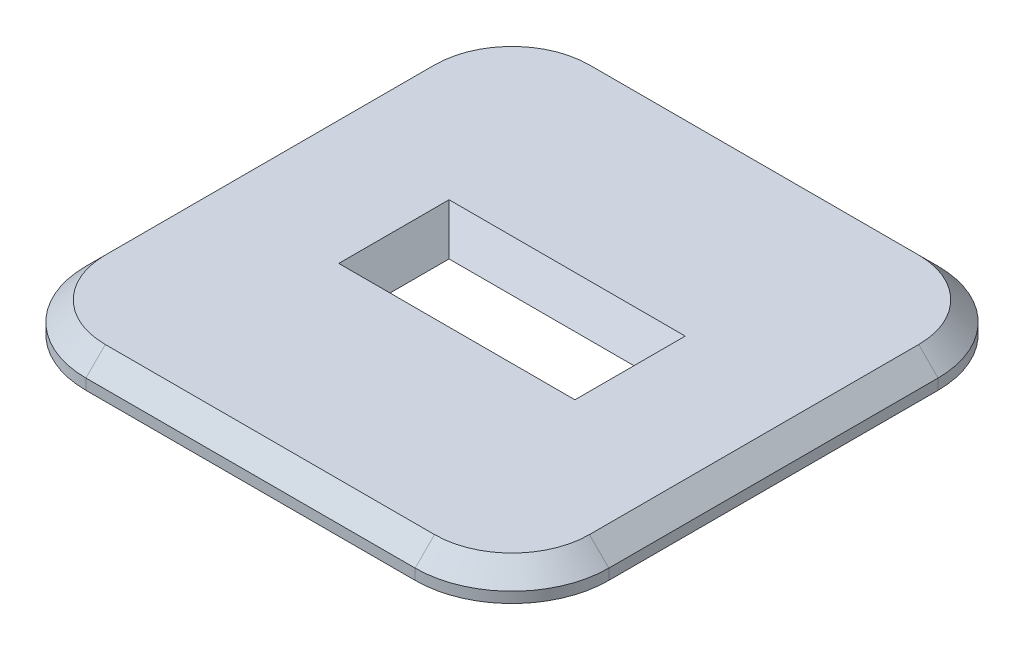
ISO-10303-21;
HEADER;
FILE_DESCRIPTION(('STEP AP214'),'2;1');
FILE_NAME('part.step','',(''),(''),'','','');
FILE_SCHEMA(('AUTOMOTIVE_DESIGN { 1 0 10303 214 1 1 1 1 }'));
ENDSEC;
DATA;
#1=APPLICATION_CONTEXT('core data for automotive mechanical design processes');
#2=APPLICATION_PROTOCOL_DEFINITION('international standard','automotive_design',2000,#1);
#3=PRODUCT_CONTEXT('',#1,'mechanical');
#4=PRODUCT('Part','Part','',(#3));
#5=PRODUCT_RELATED_PRODUCT_CATEGORY('part','',(#4));
#6=PRODUCT_DEFINITION_FORMATION('','',#4);
#7=PRODUCT_DEFINITION_CONTEXT('part definition',#1,'design');
#8=PRODUCT_DEFINITION('design','',#6,#7);
#9=PRODUCT_DEFINITION_SHAPE('','',#8);
#10=(LENGTH_UNIT() NAMED_UNIT(*) SI_UNIT(.MILLI.,.METRE.));
#11=(NAMED_UNIT(*) PLANE_ANGLE_UNIT() SI_UNIT($,.RADIAN.));
#12=(NAMED_UNIT(*) SI_UNIT($,.STERADIAN.) SOLID_ANGLE_UNIT());
#13=UNCERTAINTY_MEASURE_WITH_UNIT(LENGTH_MEASURE(1.E-05),#10,'distance_accuracy_value','');
#14=(GEOMETRIC_REPRESENTATION_CONTEXT(3) GLOBAL_UNCERTAINTY_ASSIGNED_CONTEXT((#13)) GLOBAL_UNIT_ASSIGNED_CONTEXT((#10,
#11,#12)) REPRESENTATION_CONTEXT('',''));
#15=CARTESIAN_POINT('',(0.,0.,0.));
#16=DIRECTION('',(0.,0.,1.));
#17=DIRECTION('',(1.,0.,0.));
#18=AXIS2_PLACEMENT_3D('',#15,#16,#17);
#19=CARTESIAN_POINT('',(-2.7,0.31,-2.7));
#20=DIRECTION('',(1.,0.,0.));
#21=DIRECTION('',(0.,0.,-1.));
#22=AXIS2_PLACEMENT_3D('',#19,#20,#21);
#23=PLANE('',#22);
#24=DIRECTION('',(0.,-1.,0.));
#25=VECTOR('',#24,1.);
#26=CARTESIAN_POINT('',(-2.7,0.31,1.7));
#27=LINE('',#26,#25);
#28=CARTESIAN_POINT('',(-2.7,0.,1.7));
#29=VERTEX_POINT('',#28);
#30=CARTESIAN_POINT('',(-2.7,0.11,1.7));
#31=VERTEX_POINT('',#30);
#32=EDGE_CURVE('E195',#29,#31,#27,.F.);
#33=ORIENTED_EDGE('',*,*,#32,.T.);
#34=DIRECTION('',(0.,0.,-1.));
#35=VECTOR('',#34,1.);
#36=CARTESIAN_POINT('',(-2.7,0.11,-2.7));
#37=LINE('',#36,#35);
#38=CARTESIAN_POINT('',(-2.7,0.11,-1.7));
#39=VERTEX_POINT('',#38);
#40=EDGE_CURVE('E247',#31,#39,#37,.T.);
#41=ORIENTED_EDGE('',*,*,#40,.T.);
#42=DIRECTION('',(0.,-1.,0.));
#43=VECTOR('',#42,1.);
#44=CARTESIAN_POINT('',(-2.7,0.31,-1.7));
#45=LINE('',#44,#43);
#46=CARTESIAN_POINT('',(-2.7,0.,-1.7));
#47=VERTEX_POINT('',#46);
#48=EDGE_CURVE('E198',#39,#47,#45,.T.);
#49=ORIENTED_EDGE('',*,*,#48,.T.);
#50=DIRECTION('',(0.,0.,1.));
#51=VECTOR('',#50,1.);
#52=CARTESIAN_POINT('',(-2.7,0.,-2.7));
#53=LINE('',#52,#51);
#54=EDGE_CURVE('E182',#47,#29,#53,.T.);
#55=ORIENTED_EDGE('',*,*,#54,.T.);
#56=EDGE_LOOP('',(#33,#41,#49,#55));
#57=FACE_BOUND('',#56,.T.);
#58=ADVANCED_FACE('F42',(#57),#23,.F.);
#59=CARTESIAN_POINT('',(2.7,0.31,2.7));
#60=DIRECTION('',(0.,0.,-1.));
#61=DIRECTION('',(-1.,0.,0.));
#62=AXIS2_PLACEMENT_3D('',#59,#60,#61);
#63=PLANE('',#62);
#64=DIRECTION('',(0.,-1.,0.));
#65=VECTOR('',#64,1.);
#66=CARTESIAN_POINT('',(1.7,0.31,2.7));
#67=LINE('',#66,#65);
#68=CARTESIAN_POINT('',(1.7,0.,2.7));
#69=VERTEX_POINT('',#68);
#70=CARTESIAN_POINT('',(1.7,0.11,2.7));
#71=VERTEX_POINT('',#70);
#72=EDGE_CURVE('E220',#69,#71,#67,.F.);
#73=ORIENTED_EDGE('',*,*,#72,.T.);
#74=DIRECTION('',(-1.,0.,0.));
#75=VECTOR('',#74,1.);
#76=CARTESIAN_POINT('',(2.7,0.11,2.7));
#77=LINE('',#76,#75);
#78=CARTESIAN_POINT('',(-1.7,0.11,2.7));
#79=VERTEX_POINT('',#78);
#80=EDGE_CURVE('E243',#71,#79,#77,.T.);
#81=ORIENTED_EDGE('',*,*,#80,.T.);
#82=DIRECTION('',(0.,-1.,0.));
#83=VECTOR('',#82,1.);
#84=CARTESIAN_POINT('',(-1.7,0.31,2.7));
#85=LINE('',#84,#83);
#86=CARTESIAN_POINT('',(-1.7,0.,2.7));
#87=VERTEX_POINT('',#86);
#88=EDGE_CURVE('E218',#79,#87,#85,.T.);
#89=ORIENTED_EDGE('',*,*,#88,.T.);
#90=DIRECTION('',(1.,0.,0.));
#91=VECTOR('',#90,1.);
#92=CARTESIAN_POINT('',(2.7,0.,2.7));
#93=LINE('',#92,#91);
#94=EDGE_CURVE('E185',#87,#69,#93,.T.);
#95=ORIENTED_EDGE('',*,*,#94,.T.);
#96=EDGE_LOOP('',(#73,#81,#89,#95));
#97=FACE_BOUND('',#96,.T.);
#98=ADVANCED_FACE('F298',(#97),#63,.F.);
#99=CARTESIAN_POINT('',(2.7,0.31,-2.7));
#100=DIRECTION('',(-1.,0.,0.));
#101=DIRECTION('',(0.,0.,1.));
#102=AXIS2_PLACEMENT_3D('',#99,#100,#101);
#103=PLANE('',#102);
#104=DIRECTION('',(0.,-1.,0.));
#105=VECTOR('',#104,1.);
#106=CARTESIAN_POINT('',(2.7,0.31,-1.7));
#107=LINE('',#106,#105);
#108=CARTESIAN_POINT('',(2.7,0.,-1.7));
#109=VERTEX_POINT('',#108);
#110=CARTESIAN_POINT('',(2.7,0.11,-1.7));
#111=VERTEX_POINT('',#110);
#112=EDGE_CURVE('E215',#109,#111,#107,.F.);
#113=ORIENTED_EDGE('',*,*,#112,.T.);
#114=DIRECTION('',(0.,0.,1.));
#115=VECTOR('',#114,1.);
#116=CARTESIAN_POINT('',(2.7,0.11,-2.7));
#117=LINE('',#116,#115);
#118=CARTESIAN_POINT('',(2.7,0.11,1.7));
#119=VERTEX_POINT('',#118);
#120=EDGE_CURVE('E255',#111,#119,#117,.T.);
#121=ORIENTED_EDGE('',*,*,#120,.T.);
#122=DIRECTION('',(0.,-1.,0.));
#123=VECTOR('',#122,1.);
#124=CARTESIAN_POINT('',(2.7,0.31,1.7));
#125=LINE('',#124,#123);
#126=CARTESIAN_POINT('',(2.7,0.,1.7));
#127=VERTEX_POINT('',#126);
#128=EDGE_CURVE('E213',#119,#127,#125,.T.);
#129=ORIENTED_EDGE('',*,*,#128,.T.);
#130=DIRECTION('',(0.,0.,-1.));
#131=VECTOR('',#130,1.);
#132=CARTESIAN_POINT('',(2.7,0.,-2.7));
#133=LINE('',#132,#131);
#134=EDGE_CURVE('E189',#127,#109,#133,.T.);
#135=ORIENTED_EDGE('',*,*,#134,.T.);
#136=EDGE_LOOP('',(#113,#121,#129,#135));
#137=FACE_BOUND('',#136,.T.);
#138=ADVANCED_FACE('F304',(#137),#103,.F.);
#139=CARTESIAN_POINT('',(2.7,0.31,-2.7));
#140=DIRECTION('',(0.,0.,1.));
#141=DIRECTION('',(1.,0.,0.));
#142=AXIS2_PLACEMENT_3D('',#139,#140,#141);
#143=PLANE('',#142);
#144=DIRECTION('',(0.,-1.,0.));
#145=VECTOR('',#144,1.);
#146=CARTESIAN_POINT('',(-1.7,0.31,-2.7));
#147=LINE('',#146,#145);
#148=CARTESIAN_POINT('',(-1.7,0.,-2.7));
#149=VERTEX_POINT('',#148);
#150=CARTESIAN_POINT('',(-1.7,0.11,-2.7));
#151=VERTEX_POINT('',#150);
#152=EDGE_CURVE('E210',#149,#151,#147,.F.);
#153=ORIENTED_EDGE('',*,*,#152,.T.);
#154=DIRECTION('',(1.,0.,0.));
#155=VECTOR('',#154,1.);
#156=CARTESIAN_POINT('',(2.7,0.11,-2.7));
#157=LINE('',#156,#155);
#158=CARTESIAN_POINT('',(1.7,0.11,-2.7));
#159=VERTEX_POINT('',#158);
#160=EDGE_CURVE('E251',#151,#159,#157,.T.);
#161=ORIENTED_EDGE('',*,*,#160,.T.);
#162=DIRECTION('',(0.,-1.,0.));
#163=VECTOR('',#162,1.);
#164=CARTESIAN_POINT('',(1.7,0.31,-2.7));
#165=LINE('',#164,#163);
#166=CARTESIAN_POINT('',(1.7,0.,-2.7));
#167=VERTEX_POINT('',#166);
#168=EDGE_CURVE('E208',#159,#167,#165,.T.);
#169=ORIENTED_EDGE('',*,*,#168,.T.);
#170=DIRECTION('',(-1.,0.,0.));
#171=VECTOR('',#170,1.);
#172=CARTESIAN_POINT('',(2.7,0.,-2.7));
#173=LINE('',#172,#171);
#174=EDGE_CURVE('E192',#167,#149,#173,.T.);
#175=ORIENTED_EDGE('',*,*,#174,.T.);
#176=EDGE_LOOP('',(#153,#161,#169,#175));
#177=FACE_BOUND('',#176,.T.);
#178=ADVANCED_FACE('F402',(#177),#143,.F.);
#179=CARTESIAN_POINT('',(0.,0.31,0.));
#180=DIRECTION('',(0.,-1.,0.));
#181=DIRECTION('',(0.,0.,-1.));
#182=AXIS2_PLACEMENT_3D('',#179,#180,#181);
#183=PLANE('',#182);
#184=DIRECTION('',(0.,0.,1.));
#185=VECTOR('',#184,1.);
#186=CARTESIAN_POINT('',(1.21949223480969,0.31,0.));
#187=LINE('',#186,#185);
#188=CARTESIAN_POINT('',(1.21949223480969,0.31,-0.569492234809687));
#189=VERTEX_POINT('',#188);
#190=CARTESIAN_POINT('',(1.21949223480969,0.31,0.569492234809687));
#191=VERTEX_POINT('',#190);
#192=EDGE_CURVE('E52',#189,#191,#187,.T.);
#193=ORIENTED_EDGE('',*,*,#192,.T.);
#194=DIRECTION('',(-1.,0.,0.));
#195=VECTOR('',#194,1.);
#196=CARTESIAN_POINT('',(0.,0.31,0.569492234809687));
#197=LINE('',#196,#195);
#198=CARTESIAN_POINT('',(-1.21949223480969,0.31,0.569492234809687));
#199=VERTEX_POINT('',#198);
#200=EDGE_CURVE('E11',#191,#199,#197,.T.);
#201=ORIENTED_EDGE('',*,*,#200,.T.);
#202=DIRECTION('',(0.,0.,-1.));
#203=VECTOR('',#202,1.);
#204=CARTESIAN_POINT('',(-1.21949223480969,0.31,0.));
#205=LINE('',#204,#203);
#206=CARTESIAN_POINT('',(-1.21949223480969,0.31,-0.569492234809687));
#207=VERTEX_POINT('',#206);
#208=EDGE_CURVE('E169',#199,#207,#205,.T.);
#209=ORIENTED_EDGE('',*,*,#208,.T.);
#210=DIRECTION('',(1.,0.,0.));
#211=VECTOR('',#210,1.);
#212=CARTESIAN_POINT('',(0.,0.31,-0.569492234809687));
#213=LINE('',#212,#211);
#214=EDGE_CURVE('E257',#207,#189,#213,.T.);
#215=ORIENTED_EDGE('',*,*,#214,.T.);
#216=EDGE_LOOP('',(#193,#201,#209,#215));
#217=FACE_BOUND('',#216,.T.);
#218=DIRECTION('',(1.,0.,0.));
#219=VECTOR('',#218,1.);
#220=CARTESIAN_POINT('',(0.,0.31,2.5));
#221=LINE('',#220,#219);
#222=CARTESIAN_POINT('',(-1.7,0.31,2.5));
#223=VERTEX_POINT('',#222);
#224=CARTESIAN_POINT('',(1.7,0.31,2.5));
#225=VERTEX_POINT('',#224);
#226=EDGE_CURVE('E235',#223,#225,#221,.T.);
#227=ORIENTED_EDGE('',*,*,#226,.T.);
#228=CARTESIAN_POINT('',(1.7,0.31,1.7));
#229=DIRECTION('',(0.,-1.,0.));
#230=DIRECTION('',(0.,0.,-1.));
#231=AXIS2_PLACEMENT_3D('',#228,#229,#230);
#232=CIRCLE('',#231,0.800000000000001);
#233=CARTESIAN_POINT('',(2.5,0.31,1.7));
#234=VERTEX_POINT('',#233);
#235=EDGE_CURVE('E237',#225,#234,#232,.F.);
#236=ORIENTED_EDGE('',*,*,#235,.T.);
#237=DIRECTION('',(0.,0.,-1.));
#238=VECTOR('',#237,1.);
#239=CARTESIAN_POINT('',(2.5,0.31,0.));
#240=LINE('',#239,#238);
#241=CARTESIAN_POINT('',(2.5,0.31,-1.7));
#242=VERTEX_POINT('',#241);
#243=EDGE_CURVE('E223',#234,#242,#240,.T.);
#244=ORIENTED_EDGE('',*,*,#243,.T.);
#245=CARTESIAN_POINT('',(1.7,0.31,-1.7));
#246=DIRECTION('',(0.,-1.,0.));
#247=DIRECTION('',(0.,0.,-1.));
#248=AXIS2_PLACEMENT_3D('',#245,#246,#247);
#249=CIRCLE('',#248,0.800000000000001);
#250=CARTESIAN_POINT('',(1.7,0.31,-2.5));
#251=VERTEX_POINT('',#250);
#252=EDGE_CURVE('E225',#242,#251,#249,.F.);
#253=ORIENTED_EDGE('',*,*,#252,.T.);
#254=DIRECTION('',(-1.,0.,0.));
#255=VECTOR('',#254,1.);
#256=CARTESIAN_POINT('',(0.,0.31,-2.5));
#257=LINE('',#256,#255);
#258=CARTESIAN_POINT('',(-1.7,0.31,-2.5));
#259=VERTEX_POINT('',#258);
#260=EDGE_CURVE('E227',#251,#259,#257,.T.);
#261=ORIENTED_EDGE('',*,*,#260,.T.);
#262=CARTESIAN_POINT('',(-1.7,0.31,-1.7));
#263=DIRECTION('',(0.,-1.,0.));
#264=DIRECTION('',(0.,0.,-1.));
#265=AXIS2_PLACEMENT_3D('',#262,#263,#264);
#266=CIRCLE('',#265,0.800000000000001);
#267=CARTESIAN_POINT('',(-2.5,0.31,-1.7));
#268=VERTEX_POINT('',#267);
#269=EDGE_CURVE('E229',#259,#268,#266,.F.);
#270=ORIENTED_EDGE('',*,*,#269,.T.);
#271=DIRECTION('',(0.,0.,1.));
#272=VECTOR('',#271,1.);
#273=CARTESIAN_POINT('',(-2.5,0.31,0.));
#274=LINE('',#273,#272);
#275=CARTESIAN_POINT('',(-2.5,0.31,1.7));
#276=VERTEX_POINT('',#275);
#277=EDGE_CURVE('E231',#268,#276,#274,.T.);
#278=ORIENTED_EDGE('',*,*,#277,.T.);
#279=CARTESIAN_POINT('',(-1.7,0.31,1.7));
#280=DIRECTION('',(0.,-1.,0.));
#281=DIRECTION('',(0.,0.,-1.));
#282=AXIS2_PLACEMENT_3D('',#279,#280,#281);
#283=CIRCLE('',#282,0.800000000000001);
#284=EDGE_CURVE('E233',#276,#223,#283,.F.);
#285=ORIENTED_EDGE('',*,*,#284,.T.);
#286=EDGE_LOOP('',(#227,#236,#244,#253,#261,#270,#278,#285));
#287=FACE_BOUND('',#286,.T.);
#288=ADVANCED_FACE('F286',(#217,#287),#183,.F.);
#289=CARTESIAN_POINT('',(0.,0.,0.));
#290=DIRECTION('',(0.,-1.,0.));
#291=DIRECTION('',(0.,0.,-1.));
#292=AXIS2_PLACEMENT_3D('',#289,#290,#291);
#293=PLANE('',#292);
#294=DIRECTION('',(0.,0.,1.));
#295=VECTOR('',#294,1.);
#296=CARTESIAN_POINT('',(-1.,0.,-0.35));
#297=LINE('',#296,#295);
#298=CARTESIAN_POINT('',(-1.,0.,-0.35));
#299=VERTEX_POINT('',#298);
#300=CARTESIAN_POINT('',(-1.,0.,0.35));
#301=VERTEX_POINT('',#300);
#302=EDGE_CURVE('E158',#299,#301,#297,.T.);
#303=ORIENTED_EDGE('',*,*,#302,.T.);
#304=DIRECTION('',(1.,0.,0.));
#305=VECTOR('',#304,1.);
#306=CARTESIAN_POINT('',(1.,0.,0.35));
#307=LINE('',#306,#305);
#308=CARTESIAN_POINT('',(1.,0.,0.35));
#309=VERTEX_POINT('',#308);
#310=EDGE_CURVE('E161',#301,#309,#307,.T.);
#311=ORIENTED_EDGE('',*,*,#310,.T.);
#312=DIRECTION('',(0.,0.,-1.));
#313=VECTOR('',#312,1.);
#314=CARTESIAN_POINT('',(1.,0.,-0.35));
#315=LINE('',#314,#313);
#316=CARTESIAN_POINT('',(1.,0.,-0.35));
#317=VERTEX_POINT('',#316);
#318=EDGE_CURVE('E176',#309,#317,#315,.T.);
#319=ORIENTED_EDGE('',*,*,#318,.T.);
#320=DIRECTION('',(-1.,0.,0.));
#321=VECTOR('',#320,1.);
#322=CARTESIAN_POINT('',(1.,0.,-0.35));
#323=LINE('',#322,#321);
#324=EDGE_CURVE('E163',#317,#299,#323,.T.);
#325=ORIENTED_EDGE('',*,*,#324,.T.);
#326=EDGE_LOOP('',(#303,#311,#319,#325));
#327=FACE_BOUND('',#326,.T.);
#328=ORIENTED_EDGE('',*,*,#54,.F.);
#329=CARTESIAN_POINT('',(-1.7,0.,-1.7));
#330=DIRECTION('',(0.,-1.,0.));
#331=DIRECTION('',(0.,0.,-1.));
#332=AXIS2_PLACEMENT_3D('',#329,#330,#331);
#333=CIRCLE('',#332,1.);
#334=EDGE_CURVE('E206',#47,#149,#333,.T.);
#335=ORIENTED_EDGE('',*,*,#334,.T.);
#336=ORIENTED_EDGE('',*,*,#174,.F.);
#337=CARTESIAN_POINT('',(1.7,0.,-1.7));
#338=DIRECTION('',(0.,-1.,0.));
#339=DIRECTION('',(0.,0.,-1.));
#340=AXIS2_PLACEMENT_3D('',#337,#338,#339);
#341=CIRCLE('',#340,1.);
#342=EDGE_CURVE('E204',#167,#109,#341,.T.);
#343=ORIENTED_EDGE('',*,*,#342,.T.);
#344=ORIENTED_EDGE('',*,*,#134,.F.);
#345=CARTESIAN_POINT('',(1.7,0.,1.7));
#346=DIRECTION('',(0.,-1.,0.));
#347=DIRECTION('',(0.,0.,-1.));
#348=AXIS2_PLACEMENT_3D('',#345,#346,#347);
#349=CIRCLE('',#348,1.);
#350=EDGE_CURVE('E202',#127,#69,#349,.T.);
#351=ORIENTED_EDGE('',*,*,#350,.T.);
#352=ORIENTED_EDGE('',*,*,#94,.F.);
#353=CARTESIAN_POINT('',(-1.7,0.,1.7));
#354=DIRECTION('',(0.,-1.,0.));
#355=DIRECTION('',(0.,0.,-1.));
#356=AXIS2_PLACEMENT_3D('',#353,#354,#355);
#357=CIRCLE('',#356,1.);
#358=EDGE_CURVE('E200',#87,#29,#357,.T.);
#359=ORIENTED_EDGE('',*,*,#358,.T.);
#360=EDGE_LOOP('',(#328,#335,#336,#343,#344,#351,#352,#359));
#361=FACE_BOUND('',#360,.T.);
#362=ADVANCED_FACE('F159',(#327,#361),#293,.T.);
#363=CARTESIAN_POINT('',(-1.7,0.31,-1.7));
#364=DIRECTION('',(0.,-1.,0.));
#365=DIRECTION('',(0.,0.,-1.));
#366=AXIS2_PLACEMENT_3D('',#363,#364,#365);
#367=CYLINDRICAL_SURFACE('',#366,1.);
#368=ORIENTED_EDGE('',*,*,#48,.F.);
#369=CARTESIAN_POINT('',(-1.7,0.11,-1.7));
#370=DIRECTION('',(0.,-1.,0.));
#371=DIRECTION('',(0.,0.,-1.));
#372=AXIS2_PLACEMENT_3D('',#369,#370,#371);
#373=CIRCLE('',#372,1.);
#374=EDGE_CURVE('E249',#39,#151,#373,.T.);
#375=ORIENTED_EDGE('',*,*,#374,.T.);
#376=ORIENTED_EDGE('',*,*,#152,.F.);
#377=ORIENTED_EDGE('',*,*,#334,.F.);
#378=EDGE_LOOP('',(#368,#375,#376,#377));
#379=FACE_BOUND('',#378,.T.);
#380=ADVANCED_FACE('F309',(#379),#367,.T.);
#381=CARTESIAN_POINT('',(1.7,0.31,-1.7));
#382=DIRECTION('',(0.,-1.,0.));
#383=DIRECTION('',(0.,0.,-1.));
#384=AXIS2_PLACEMENT_3D('',#381,#382,#383);
#385=CYLINDRICAL_SURFACE('',#384,1.);
#386=ORIENTED_EDGE('',*,*,#168,.F.);
#387=CARTESIAN_POINT('',(1.7,0.11,-1.7));
#388=DIRECTION('',(0.,-1.,0.));
#389=DIRECTION('',(0.,0.,-1.));
#390=AXIS2_PLACEMENT_3D('',#387,#388,#389);
#391=CIRCLE('',#390,1.);
#392=EDGE_CURVE('E253',#159,#111,#391,.T.);
#393=ORIENTED_EDGE('',*,*,#392,.T.);
#394=ORIENTED_EDGE('',*,*,#112,.F.);
#395=ORIENTED_EDGE('',*,*,#342,.F.);
#396=EDGE_LOOP('',(#386,#393,#394,#395));
#397=FACE_BOUND('',#396,.T.);
#398=ADVANCED_FACE('F312',(#397),#385,.T.);
#399=CARTESIAN_POINT('',(1.7,0.31,1.7));
#400=DIRECTION('',(0.,-1.,0.));
#401=DIRECTION('',(0.,0.,-1.));
#402=AXIS2_PLACEMENT_3D('',#399,#400,#401);
#403=CYLINDRICAL_SURFACE('',#402,1.);
#404=ORIENTED_EDGE('',*,*,#128,.F.);
#405=CARTESIAN_POINT('',(1.7,0.11,1.7));
#406=DIRECTION('',(0.,-1.,0.));
#407=DIRECTION('',(0.,0.,-1.));
#408=AXIS2_PLACEMENT_3D('',#405,#406,#407);
#409=CIRCLE('',#408,1.);
#410=EDGE_CURVE('E240',#119,#71,#409,.T.);
#411=ORIENTED_EDGE('',*,*,#410,.T.);
#412=ORIENTED_EDGE('',*,*,#72,.F.);
#413=ORIENTED_EDGE('',*,*,#350,.F.);
#414=EDGE_LOOP('',(#404,#411,#412,#413));
#415=FACE_BOUND('',#414,.T.);
#416=ADVANCED_FACE('F316',(#415),#403,.T.);
#417=CARTESIAN_POINT('',(-1.7,0.31,1.7));
#418=DIRECTION('',(0.,-1.,0.));
#419=DIRECTION('',(0.,0.,-1.));
#420=AXIS2_PLACEMENT_3D('',#417,#418,#419);
#421=CYLINDRICAL_SURFACE('',#420,1.);
#422=ORIENTED_EDGE('',*,*,#88,.F.);
#423=CARTESIAN_POINT('',(-1.7,0.11,1.7));
#424=DIRECTION('',(0.,-1.,0.));
#425=DIRECTION('',(0.,0.,-1.));
#426=AXIS2_PLACEMENT_3D('',#423,#424,#425);
#427=CIRCLE('',#426,1.);
#428=EDGE_CURVE('E245',#79,#31,#427,.T.);
#429=ORIENTED_EDGE('',*,*,#428,.T.);
#430=ORIENTED_EDGE('',*,*,#32,.F.);
#431=ORIENTED_EDGE('',*,*,#358,.F.);
#432=EDGE_LOOP('',(#422,#429,#430,#431));
#433=FACE_BOUND('',#432,.T.);
#434=ADVANCED_FACE('F320',(#433),#421,.T.);
#435=CARTESIAN_POINT('',(-1.7,0.31,-1.7));
#436=DIRECTION('',(0.,-1.,0.));
#437=DIRECTION('',(0.,0.,-1.));
#438=AXIS2_PLACEMENT_3D('',#435,#436,#437);
#439=CONICAL_SURFACE('',#438,0.800000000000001,0.785398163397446);
#440=DIRECTION('',(0.,0.707106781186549,0.707106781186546));
#441=VECTOR('',#440,1.);
#442=CARTESIAN_POINT('',(-1.7,0.11,-2.7));
#443=LINE('',#442,#441);
#444=EDGE_CURVE('E273',#151,#259,#443,.T.);
#445=ORIENTED_EDGE('',*,*,#444,.F.);
#446=ORIENTED_EDGE('',*,*,#374,.F.);
#447=DIRECTION('',(-0.707106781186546,-0.707106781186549,0.));
#448=VECTOR('',#447,1.);
#449=CARTESIAN_POINT('',(-2.5,0.31,-1.7));
#450=LINE('',#449,#448);
#451=EDGE_CURVE('E186',#268,#39,#450,.T.);
#452=ORIENTED_EDGE('',*,*,#451,.F.);
#453=ORIENTED_EDGE('',*,*,#269,.F.);
#454=EDGE_LOOP('',(#445,#446,#452,#453));
#455=FACE_BOUND('',#454,.T.);
#456=ADVANCED_FACE('F324',(#455),#439,.T.);
#457=CARTESIAN_POINT('',(-2.5,0.31,0.));
#458=DIRECTION('',(0.707106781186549,-0.707106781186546,0.));
#459=DIRECTION('',(0.,0.,1.));
#460=AXIS2_PLACEMENT_3D('',#457,#458,#459);
#461=PLANE('',#460);
#462=ORIENTED_EDGE('',*,*,#451,.T.);
#463=ORIENTED_EDGE('',*,*,#40,.F.);
#464=DIRECTION('',(-0.707106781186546,-0.707106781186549,0.));
#465=VECTOR('',#464,1.);
#466=CARTESIAN_POINT('',(-2.5,0.31,1.7));
#467=LINE('',#466,#465);
#468=EDGE_CURVE('E270',#276,#31,#467,.T.);
#469=ORIENTED_EDGE('',*,*,#468,.F.);
#470=ORIENTED_EDGE('',*,*,#277,.F.);
#471=EDGE_LOOP('',(#462,#463,#469,#470));
#472=FACE_BOUND('',#471,.T.);
#473=ADVANCED_FACE('F368',(#472),#461,.F.);
#474=CARTESIAN_POINT('',(0.,0.31,-2.5));
#475=DIRECTION('',(0.,-0.707106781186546,0.707106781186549));
#476=DIRECTION('',(-1.,0.,0.));
#477=AXIS2_PLACEMENT_3D('',#474,#475,#476);
#478=PLANE('',#477);
#479=ORIENTED_EDGE('',*,*,#444,.T.);
#480=ORIENTED_EDGE('',*,*,#260,.F.);
#481=DIRECTION('',(0.,0.707106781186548,0.707106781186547));
#482=VECTOR('',#481,1.);
#483=CARTESIAN_POINT('',(1.7,0.11,-2.7));
#484=LINE('',#483,#482);
#485=EDGE_CURVE('E267',#159,#251,#484,.T.);
#486=ORIENTED_EDGE('',*,*,#485,.F.);
#487=ORIENTED_EDGE('',*,*,#160,.F.);
#488=EDGE_LOOP('',(#479,#480,#486,#487));
#489=FACE_BOUND('',#488,.T.);
#490=ADVANCED_FACE('F361',(#489),#478,.F.);
#491=CARTESIAN_POINT('',(-1.7,0.31,1.7));
#492=DIRECTION('',(0.,-1.,0.));
#493=DIRECTION('',(0.,0.,-1.));
#494=AXIS2_PLACEMENT_3D('',#491,#492,#493);
#495=CONICAL_SURFACE('',#494,0.800000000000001,0.785398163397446);
#496=ORIENTED_EDGE('',*,*,#468,.T.);
#497=ORIENTED_EDGE('',*,*,#428,.F.);
#498=DIRECTION('',(0.,-0.707106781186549,0.707106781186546));
#499=VECTOR('',#498,1.);
#500=CARTESIAN_POINT('',(-1.7,0.31,2.5));
#501=LINE('',#500,#499);
#502=EDGE_CURVE('E264',#223,#79,#501,.T.);
#503=ORIENTED_EDGE('',*,*,#502,.F.);
#504=ORIENTED_EDGE('',*,*,#284,.F.);
#505=EDGE_LOOP('',(#496,#497,#503,#504));
#506=FACE_BOUND('',#505,.T.);
#507=ADVANCED_FACE('F354',(#506),#495,.T.);
#508=CARTESIAN_POINT('',(1.7,0.31,-1.7));
#509=DIRECTION('',(0.,-1.,0.));
#510=DIRECTION('',(0.,0.,-1.));
#511=AXIS2_PLACEMENT_3D('',#508,#509,#510);
#512=CONICAL_SURFACE('',#511,0.800000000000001,0.785398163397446);
#513=ORIENTED_EDGE('',*,*,#485,.T.);
#514=ORIENTED_EDGE('',*,*,#252,.F.);
#515=DIRECTION('',(-0.707106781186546,0.707106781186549,0.));
#516=VECTOR('',#515,1.);
#517=CARTESIAN_POINT('',(2.7,0.11,-1.7));
#518=LINE('',#517,#516);
#519=EDGE_CURVE('E261',#111,#242,#518,.T.);
#520=ORIENTED_EDGE('',*,*,#519,.F.);
#521=ORIENTED_EDGE('',*,*,#392,.F.);
#522=EDGE_LOOP('',(#513,#514,#520,#521));
#523=FACE_BOUND('',#522,.T.);
#524=ADVANCED_FACE('F347',(#523),#512,.T.);
#525=CARTESIAN_POINT('',(0.,0.31,2.5));
#526=DIRECTION('',(0.,-0.707106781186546,-0.707106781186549));
#527=DIRECTION('',(1.,0.,0.));
#528=AXIS2_PLACEMENT_3D('',#525,#526,#527);
#529=PLANE('',#528);
#530=ORIENTED_EDGE('',*,*,#502,.T.);
#531=ORIENTED_EDGE('',*,*,#80,.F.);
#532=DIRECTION('',(0.,-0.707106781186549,0.707106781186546));
#533=VECTOR('',#532,1.);
#534=CARTESIAN_POINT('',(1.7,0.31,2.5));
#535=LINE('',#534,#533);
#536=EDGE_CURVE('E259',#225,#71,#535,.T.);
#537=ORIENTED_EDGE('',*,*,#536,.F.);
#538=ORIENTED_EDGE('',*,*,#226,.F.);
#539=EDGE_LOOP('',(#530,#531,#537,#538));
#540=FACE_BOUND('',#539,.T.);
#541=ADVANCED_FACE('F340',(#540),#529,.F.);
#542=CARTESIAN_POINT('',(2.5,0.31,0.));
#543=DIRECTION('',(-0.707106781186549,-0.707106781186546,0.));
#544=DIRECTION('',(0.,0.,-1.));
#545=AXIS2_PLACEMENT_3D('',#542,#543,#544);
#546=PLANE('',#545);
#547=ORIENTED_EDGE('',*,*,#519,.T.);
#548=ORIENTED_EDGE('',*,*,#243,.F.);
#549=DIRECTION('',(-0.707106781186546,0.707106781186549,0.));
#550=VECTOR('',#549,1.);
#551=CARTESIAN_POINT('',(2.7,0.11,1.7));
#552=LINE('',#551,#550);
#553=EDGE_CURVE('E181',#119,#234,#552,.T.);
#554=ORIENTED_EDGE('',*,*,#553,.F.);
#555=ORIENTED_EDGE('',*,*,#120,.F.);
#556=EDGE_LOOP('',(#547,#548,#554,#555));
#557=FACE_BOUND('',#556,.T.);
#558=ADVANCED_FACE('F333',(#557),#546,.F.);
#559=CARTESIAN_POINT('',(1.7,0.31,1.7));
#560=DIRECTION('',(0.,-1.,0.));
#561=DIRECTION('',(0.,0.,-1.));
#562=AXIS2_PLACEMENT_3D('',#559,#560,#561);
#563=CONICAL_SURFACE('',#562,0.800000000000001,0.785398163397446);
#564=ORIENTED_EDGE('',*,*,#536,.T.);
#565=ORIENTED_EDGE('',*,*,#410,.F.);
#566=ORIENTED_EDGE('',*,*,#553,.T.);
#567=ORIENTED_EDGE('',*,*,#235,.F.);
#568=EDGE_LOOP('',(#564,#565,#566,#567));
#569=FACE_BOUND('',#568,.T.);
#570=ADVANCED_FACE('F327',(#569),#563,.T.);
#571=CARTESIAN_POINT('',(1.,0.,-0.35));
#572=DIRECTION('',(0.,-0.577857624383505,-0.81613759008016));
#573=DIRECTION('',(-1.,0.,0.));
#574=AXIS2_PLACEMENT_3D('',#571,#572,#573);
#575=PLANE('',#574);
#576=DIRECTION('',(0.500329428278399,0.7066405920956,-0.500329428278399));
#577=VECTOR('',#576,1.);
#578=CARTESIAN_POINT('',(1.,0.,-0.35));
#579=LINE('',#578,#577);
#580=EDGE_CURVE('E170',#189,#317,#579,.F.);
#581=ORIENTED_EDGE('',*,*,#580,.F.);
#582=ORIENTED_EDGE('',*,*,#214,.F.);
#583=DIRECTION('',(0.500329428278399,-0.7066405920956,0.500329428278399));
#584=VECTOR('',#583,1.);
#585=CARTESIAN_POINT('',(-1.,0.,-0.35));
#586=LINE('',#585,#584);
#587=EDGE_CURVE('E47',#299,#207,#586,.F.);
#588=ORIENTED_EDGE('',*,*,#587,.F.);
#589=ORIENTED_EDGE('',*,*,#324,.F.);
#590=EDGE_LOOP('',(#581,#582,#588,#589));
#591=FACE_BOUND('',#590,.T.);
#592=ADVANCED_FACE('F45',(#591),#575,.F.);
#593=CARTESIAN_POINT('',(-1.,0.,-0.35));
#594=DIRECTION('',(-0.81613759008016,-0.577857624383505,0.));
#595=DIRECTION('',(0.,0.,1.));
#596=AXIS2_PLACEMENT_3D('',#593,#594,#595);
#597=PLANE('',#596);
#598=ORIENTED_EDGE('',*,*,#587,.T.);
#599=ORIENTED_EDGE('',*,*,#208,.F.);
#600=DIRECTION('',(0.500329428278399,-0.7066405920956,-0.500329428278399));
#601=VECTOR('',#600,1.);
#602=CARTESIAN_POINT('',(-0.49934092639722,-0.707106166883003,-0.150659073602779));
#603=LINE('',#602,#601);
#604=EDGE_CURVE('E65',#301,#199,#603,.F.);
#605=ORIENTED_EDGE('',*,*,#604,.F.);
#606=ORIENTED_EDGE('',*,*,#302,.F.);
#607=EDGE_LOOP('',(#598,#599,#605,#606));
#608=FACE_BOUND('',#607,.T.);
#609=ADVANCED_FACE('F168',(#608),#597,.F.);
#610=CARTESIAN_POINT('',(1.,0.,-0.35));
#611=DIRECTION('',(0.81613759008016,-0.577857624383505,0.));
#612=DIRECTION('',(0.,0.,-1.));
#613=AXIS2_PLACEMENT_3D('',#610,#611,#612);
#614=PLANE('',#613);
#615=ORIENTED_EDGE('',*,*,#580,.T.);
#616=ORIENTED_EDGE('',*,*,#318,.F.);
#617=DIRECTION('',(0.500329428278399,0.7066405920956,0.500329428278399));
#618=VECTOR('',#617,1.);
#619=CARTESIAN_POINT('',(1.,0.,0.35));
#620=LINE('',#619,#618);
#621=EDGE_CURVE('E171',#191,#309,#620,.F.);
#622=ORIENTED_EDGE('',*,*,#621,.F.);
#623=ORIENTED_EDGE('',*,*,#192,.F.);
#624=EDGE_LOOP('',(#615,#616,#622,#623));
#625=FACE_BOUND('',#624,.T.);
#626=ADVANCED_FACE('F288',(#625),#614,.F.);
#627=CARTESIAN_POINT('',(1.,0.,0.35));
#628=DIRECTION('',(0.,-0.577857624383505,0.81613759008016));
#629=DIRECTION('',(1.,0.,0.));
#630=AXIS2_PLACEMENT_3D('',#627,#628,#629);
#631=PLANE('',#630);
#632=ORIENTED_EDGE('',*,*,#604,.T.);
#633=ORIENTED_EDGE('',*,*,#200,.F.);
#634=ORIENTED_EDGE('',*,*,#621,.T.);
#635=ORIENTED_EDGE('',*,*,#310,.F.);
#636=EDGE_LOOP('',(#632,#633,#634,#635));
#637=FACE_BOUND('',#636,.T.);
#638=ADVANCED_FACE('F173',(#637),#631,.F.);
#639=CLOSED_SHELL('',(#58,#98,#138,#178,#288,#362,#380,#398,#416,#434,#456,#473,#490,#507,#524,
#541,#558,#570,#592,#609,#626,#638));
#640=MANIFOLD_SOLID_BREP('B2',#639);
#641=ADVANCED_BREP_SHAPE_REPRESENTATION('',(#18,#640),#14);
#642=SHAPE_DEFINITION_REPRESENTATION(#9,#641);
ENDSEC;
END-ISO-10303-21;
